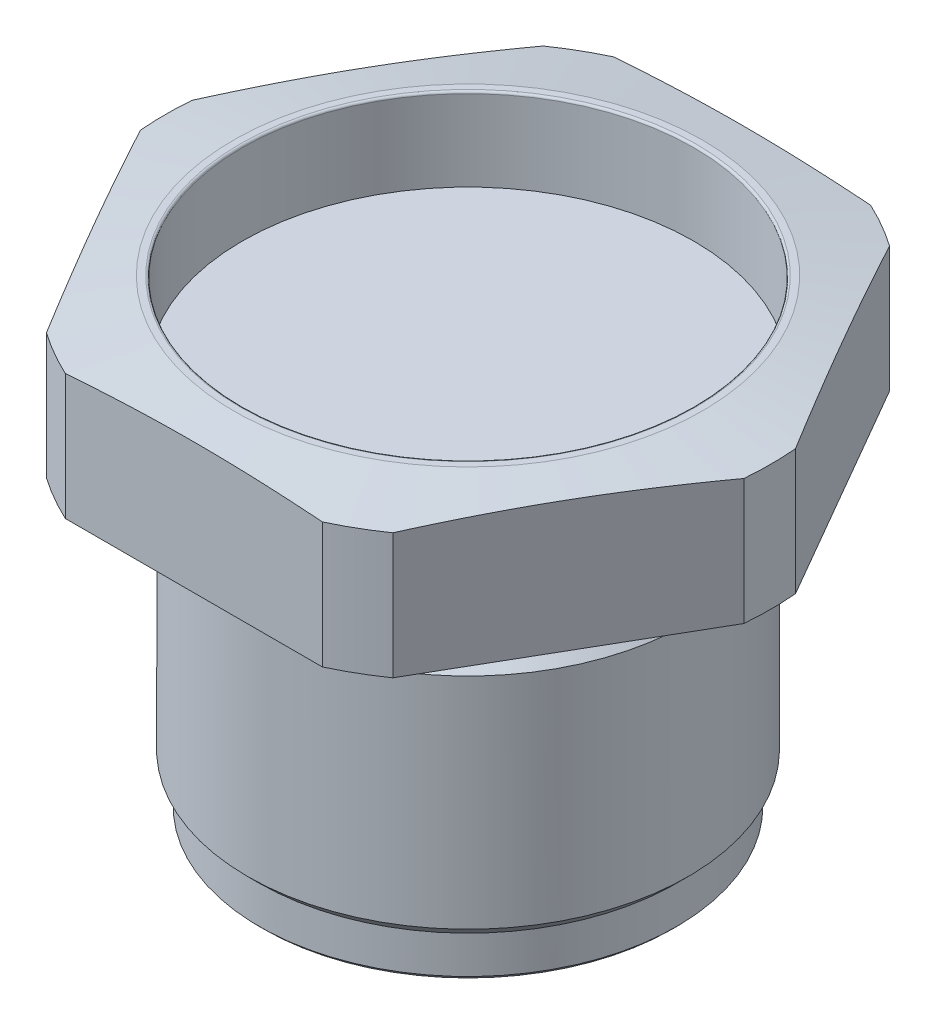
from build123d import *

# Parameters (mm, degrees)
FILLET7_R          = 0.25
SKETCH7_OUTSIDE_W  = 94.32
SKETCH7_OUTSIDE_H  = 94.32
CUT_EXTRUDE5_DEPTH = 63.100657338
CHAMFER2_SIZE      = 0.49999776
FILLET8_R          = 0.508
SKETCH9_W          = 9.0043
SKETCH9_H          = 1.3716


with BuildPart() as part:
    # Sketch6 → Revolve3 (revolve)
    with BuildSketch(Plane.XY, mode=Mode.PRIVATE) as revolve3_sk:
        Polygon((26.035, 15.875), (27.051, 15.875), (34.925, 14.486601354), (34.925, 0), (24.0500027, 0), (24.0500027, -37.6428), (0, -37.6428), (0, 6.2992), (26.035, 6.2992), align=None)
    revolve(revolve3_sk.sketch.rotate(Axis((0, -8.968942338, 0), (0, 1, 0)), 90), axis=Axis((0, -8.968942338, 0), (0, 1, 0)))

    # Fillet7
    fillet7_edges = [part.edges().sort_by_distance(p)[0] for p in [
        (0, 15.875, 26.035),
    ]]
    fillet(fillet7_edges, radius=FILLET7_R)

    # Sketch7 outside → Cut-Extrude5 (cut, through all)
    with BuildSketch(Plane.XZ):
        Rectangle(SKETCH7_OUTSIDE_W, SKETCH7_OUTSIDE_H)
        Polygon((-18.257547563, 31.623), (18.257547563, 31.623), (36.515095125, 0), (18.257547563, -31.623), (-18.257547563, -31.623), (-36.515095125, 0), align=None, mode=Mode.SUBTRACT)
    extrude(amount=-CUT_EXTRUDE5_DEPTH, mode=Mode.SUBTRACT)

    # Chamfer2
    chamfer2_edges = [part.edges().sort_by_distance(p)[0] for p in [
        (0, -37.6428, 24.0500027),
    ]]
    chamfer(chamfer2_edges, length=CHAMFER2_SIZE)

    # Sketch8 → Revolve4 (revolve)
    with BuildSketch(Plane.XY, mode=Mode.PRIVATE) as revolve4_sk:
        Polygon((-24.0500027, -4.826), (-24.0500027, -32.8168), (-25.4, -31.4668027), (-25.4, -6.1759973), align=None)
    revolve(revolve4_sk.sketch.rotate(Axis((0, 0, 0), (0, -1, 0)), 90), axis=Axis((0, 0, 0), (0, -1, 0)))

    # Fillet8
    fillet8_edges = [part.edges().sort_by_distance(p)[0] for p in [
        (0, 0, 24.0500027),
    ]]
    fillet(fillet8_edges, radius=FILLET8_R)

    # Sketch9 → Cut-Revolve1 (revolve, cut)
    with BuildSketch(Plane.XY, mode=Mode.PRIVATE) as cut_revolve1_sk:
        with Locations((4.50215, -36.957)):
            Rectangle(SKETCH9_W, SKETCH9_H)
        with BuildLine():
            Line((10.9728, -37.6428), (10.9728, -37.1602))
            ThreePointArc((10.9728, -37.1602), (11.009141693, -37.411784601), (11.115195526, -37.6428))
            Line((11.115195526, -37.6428), (10.9728, -37.6428))
        make_face()
        with BuildLine():
            Line((12.7508, -37.1602), (12.7508, -37.6428))
            Line((12.7508, -37.6428), (12.608404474, -37.6428))
            ThreePointArc((12.608404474, -37.6428), (12.714458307, -37.411784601), (12.7508, -37.1602))
        make_face()
        with BuildLine():
            Line((15.7226, -36.2712), (21.3868, -36.2712))
            ThreePointArc((21.3868, -36.2712), (20.605982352, -36.735176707), (20.640195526, -37.6428))
            Line((20.640195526, -37.6428), (14.351, -37.6428))
            ThreePointArc((14.351, -37.6428), (14.752732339, -36.672932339), (15.7226, -36.2712))
        make_face()
    revolve(cut_revolve1_sk.sketch.rotate(Axis((0, 0, 0), (0, -1, 0)), 180), axis=Axis((0, 0, 0), (0, -1, 0)), mode=Mode.SUBTRACT)

    # Sketch10 → Revolve6 (revolve)
    with BuildSketch(Plane.XY, mode=Mode.PRIVATE) as revolve6_sk:
        with BuildLine():
            Line((-22.156362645, -37.605277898), (-20.617237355, -37.605277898))
            ThreePointArc((-20.617237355, -37.605277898), (-21.3868, -38.0492), (-22.156362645, -37.605277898))
        make_face()
        with BuildLine():
            Line((-12.631362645, -37.605277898), (-11.092237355, -37.605277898))
            ThreePointArc((-11.092237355, -37.605277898), (-11.8618, -38.0492), (-12.631362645, -37.605277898))
        make_face()
    revolve(revolve6_sk.sketch.rotate(Axis((0, 0, 0), (0, -1, 0)), 270), axis=Axis((0, 0, 0), (0, -1, 0)))


solid = part.part
